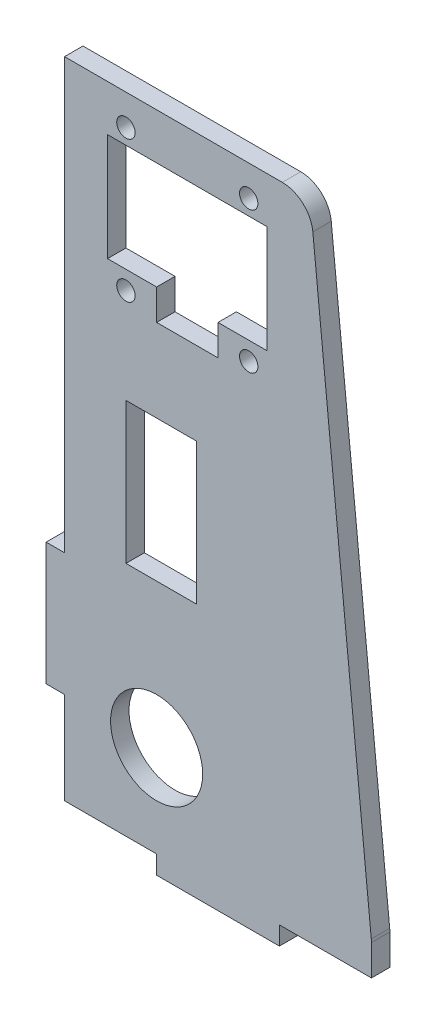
from build123d import *

# Parameters (mm, degrees)
ESQUISSE1_R        = 1.5
ESQUISSE1_R_2      = 7.5
ESQUISSE1_W        = 11.5
ESQUISSE1_H        = 23
BOSS_EXTRU_1_DEPTH = 3


with BuildPart() as part:
    # Esquisse1 → Boss.-Extru.1 (new body)
    with BuildSketch(Plane.XY):
        with BuildLine():
            Line((0, 0), (0, 15))
            Line((0, 15), (-3, 15))
            Line((-3, 15), (-3, 35))
            Line((-3, 35), (0, 35))
            Line((0, 35), (0, 105))
            Line((0, 105), (35.476190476, 105))
            ThreePointArc((35.476190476, 105), (38.830757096, 103.707678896), (40.45125282, 100.498753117))
            Line((40.45125282, 100.498753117), (49.975062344, 5.498753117))
            ThreePointArc((49.975062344, 5.498753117), (49.993761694, 5.249688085), (50, 5))
            Line((50, 5), (50, 0))
            Line((50, 0), (35, 0))
            Line((35, 0), (35, -3))
            Line((35, -3), (15, -3))
            Line((15, -3), (15, 0))
            Line((15, 0), (0, 0))
        make_face()
        with Locations((10, 100)):
            Circle(ESQUISSE1_R, mode=Mode.SUBTRACT)
        with Locations((30, 100)):
            Circle(ESQUISSE1_R, mode=Mode.SUBTRACT)
        with Locations((10, 77)):
            Circle(ESQUISSE1_R, mode=Mode.SUBTRACT)
        with Locations((30, 77)):
            Circle(ESQUISSE1_R, mode=Mode.SUBTRACT)
        with Locations((15, 15)):
            Circle(ESQUISSE1_R_2, mode=Mode.SUBTRACT)
        with Locations((15.75, 50)):
            Rectangle(ESQUISSE1_W, ESQUISSE1_H, mode=Mode.SUBTRACT)
        Polygon((7, 97.5), (33, 97.5), (33, 80), (25, 80), (25, 75), (15, 75), (15, 80), (7, 80), align=None, mode=Mode.SUBTRACT)
    extrude(amount=BOSS_EXTRU_1_DEPTH)


solid = part.part
